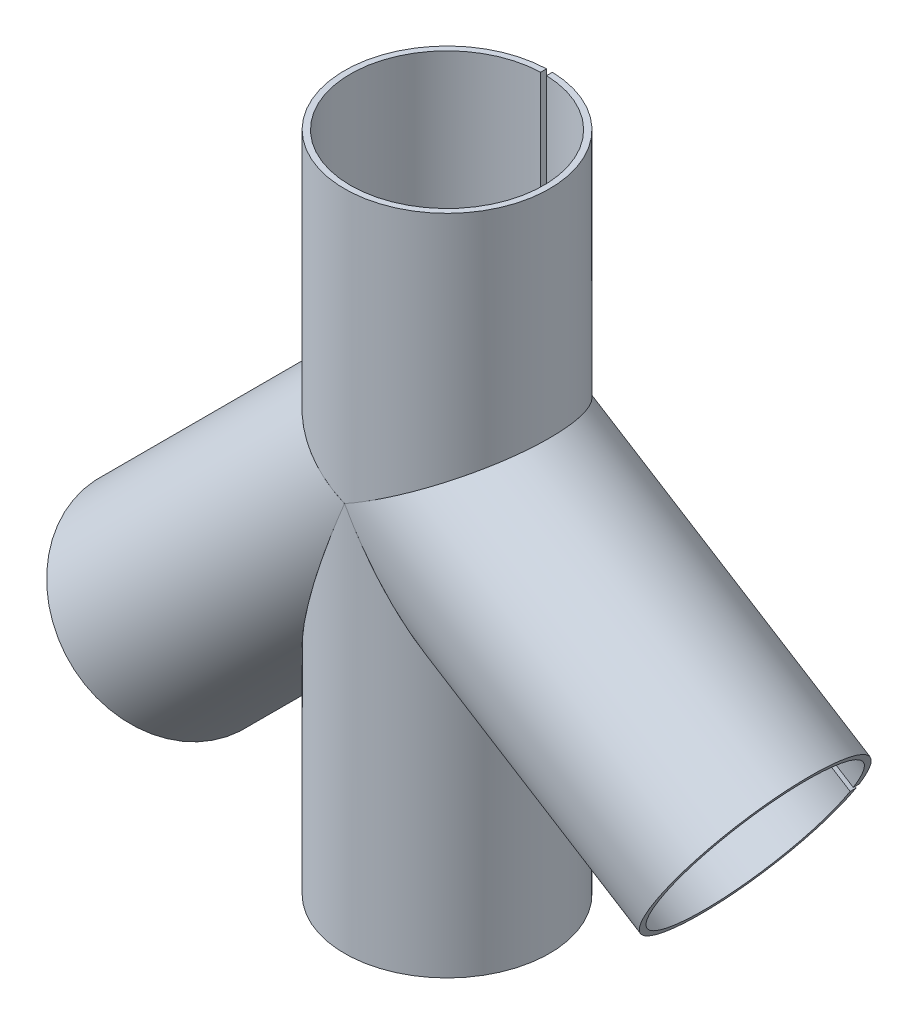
from build123d import *

# Parameters (mm, degrees)
SKETCH_2_R               = 17.363078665
SKETCH_2_R_2             = 16.363078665
EXTRUDE_1_DEPTH          = 46.170396
SKETCH_3_R               = 17.363078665
SKETCH_3_R_2             = 16.363078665
EXTRUDE_2_DEPTH          = 61.591845
SKETCH_4_R               = 17.363078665
SKETCH_4_R_2             = 16.363078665
EXTRUDE_3_DEPTH          = 65.849104
SKETCH_5_R               = 17.363078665
SKETCH_5_R_2             = 16.363078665
EXTRUDE_4_DEPTH          = 66
CUT_EXTRUDE_1_DEPTH      = 92.810284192
CUT_EXTRUDE_1_DEPTH_BACK = 92.810284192
SKETCH_6_OUTSIDE_W       = 155.868
SKETCH_6_OUTSIDE_H       = 147.784
CUT_EXTRUDE_2_DEPTH      = 92.810284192
CUT_EXTRUDE_2_DEPTH_BACK = 92.810284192
SKETCH_7_OUTSIDE_W       = 155.868
SKETCH_7_OUTSIDE_H       = 147.784
CUT_EXTRUDE_5_DEPTH      = 92.810284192
CUT_EXTRUDE_5_DEPTH_BACK = 92.810284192
SKETCH_10_OUTSIDE_W      = 155.868
SKETCH_10_OUTSIDE_H      = 147.784
CUT_EXTRUDE_6_DEPTH      = 92.810284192
CUT_EXTRUDE_6_DEPTH_BACK = 92.810284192
SKETCH_11_OUTSIDE_W      = 155.868
SKETCH_11_OUTSIDE_H      = 147.784
CUT_EXTRUDE_6_2_DEPTH    = 92.810284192
CUT_EXTRUDE_7_DEPTH      = 92.810284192


with BuildPart() as part:
    # Sketch 2 → Extrude 1 (new body)
    with BuildSketch(Plane(origin=(0, 0, 0), x_dir=(1, 0, 0), z_dir=(0, 1, 0))):
        Circle(SKETCH_2_R)
        Circle(SKETCH_2_R_2, mode=Mode.SUBTRACT)
    extrude(amount=EXTRUDE_1_DEPTH)

    # Sketch 6 outside → Cut-Extrude 1 (cut, two sides: drawn at the far end of the back side and taken through both)
    with BuildSketch(Plane.XY.offset(-CUT_EXTRUDE_1_DEPTH_BACK)):
        with Locations((1.287, -9.915)):
            Rectangle(SKETCH_6_OUTSIDE_W, SKETCH_6_OUTSIDE_H)
        Polygon((-17.363078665, 7.192022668), (0, 0), (17.363078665, 9.611805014), (17.363078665, 46.170395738), (-17.363078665, 46.170395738), align=None, mode=Mode.SUBTRACT)
    extrude(amount=CUT_EXTRUDE_1_DEPTH + CUT_EXTRUDE_1_DEPTH_BACK, mode=Mode.SUBTRACT)


with BuildPart() as body_2:
    # Sketch 3 → Extrude 2 (new body)
    with BuildSketch(Plane(origin=(52.196259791, -32.69718417, 0), x_dir=(0, 0, -1), z_dir=(0.8474540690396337, -0.5308687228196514, 0))):
        Circle(SKETCH_3_R)
        Circle(SKETCH_3_R_2, mode=Mode.SUBTRACT)
    extrude(amount=-EXTRUDE_2_DEPTH)

    # Sketch 11 outside → Cut-Extrude 6 (cut, two sides: drawn at the far end of the back side and taken through both)
    with BuildSketch(Plane.XY.offset(-CUT_EXTRUDE_6_DEPTH_BACK)):
        with Locations((1.287, -9.915)):
            Rectangle(SKETCH_11_OUTSIDE_W, SKETCH_11_OUTSIDE_H)
        Polygon((0, 0), (17.363078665, -31.365232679), (42.978744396, -47.411595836), (61.413775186, -17.982772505), (17.363078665, 9.611805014), align=None, mode=Mode.SUBTRACT)
    extrude(amount=CUT_EXTRUDE_6_DEPTH + CUT_EXTRUDE_6_DEPTH_BACK, mode=Mode.SUBTRACT)


with BuildPart() as body_3:
    # Sketch 4 → Extrude 3 (new body)
    with BuildSketch(Plane(origin=(-46.562348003, -46.562348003, 0), x_dir=(0.7071067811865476, -0.7071067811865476, 0), z_dir=(-0.7071067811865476, -0.7071067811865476, 0))):
        Circle(SKETCH_4_R)
        Circle(SKETCH_4_R_2, mode=Mode.SUBTRACT)
    extrude(amount=-EXTRUDE_3_DEPTH)

    # Sketch 7 outside → Cut-Extrude 2 (cut, two sides: drawn at the far end of the back side and taken through both)
    with BuildSketch(Plane.XY.offset(-CUT_EXTRUDE_2_DEPTH_BACK)):
        with Locations((1.287, -9.915)):
            Rectangle(SKETCH_7_OUTSIDE_W, SKETCH_7_OUTSIDE_H)
        Polygon((-17.363078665, 7.192022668), (0, 0), (-17.363078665, -41.918179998), (-34.284797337, -58.839898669), (-58.839898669, -34.284797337), align=None, mode=Mode.SUBTRACT)
    extrude(amount=CUT_EXTRUDE_2_DEPTH + CUT_EXTRUDE_2_DEPTH_BACK, mode=Mode.SUBTRACT)


with BuildPart() as body_4:
    # Sketch 5 → Extrude 4 (new body)
    with BuildSketch(Plane(origin=(0, 0, 0), x_dir=(1, 0, 0), z_dir=(0, 1, 0))):
        Circle(SKETCH_5_R)
        Circle(SKETCH_5_R_2, mode=Mode.SUBTRACT)
    extrude(amount=-EXTRUDE_4_DEPTH)

    # Sketch 10 outside → Cut-Extrude 5 (cut, two sides: drawn at the far end of the back side and taken through both)
    with BuildSketch(Plane.XY.offset(-CUT_EXTRUDE_5_DEPTH_BACK)):
        with Locations((1.287, -9.915)):
            Rectangle(SKETCH_10_OUTSIDE_W, SKETCH_10_OUTSIDE_H)
        Polygon((-17.363078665, -41.918179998), (-17.363078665, -66), (17.363078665, -66), (17.363078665, -31.365232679), (0, 0), align=None, mode=Mode.SUBTRACT)
    extrude(amount=CUT_EXTRUDE_5_DEPTH + CUT_EXTRUDE_5_DEPTH_BACK, mode=Mode.SUBTRACT)


with BuildPart() as cut_extrude_6_2_tool:
    # Sketch 1 → Cut-Extrude 6 2 (new, through all)
    with BuildSketch(Plane.XY):
        Polygon((52.461694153, -32.273457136), (0.5, 0.276788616), (0.5, 46.170395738), (-0.5, 46.170395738), (-0.5, -0.276788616), (51.93082543, -33.120911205), align=None)
    extrude(amount=-CUT_EXTRUDE_6_2_DEPTH)


with BuildPart() as part_1:
    add(part.part)

    # Cut-Extrude 6 2: cut by cut_extrude_6_2_tool
    add(cut_extrude_6_2_tool.part, mode=Mode.SUBTRACT)


with BuildPart() as body_2_1:
    add(body_2.part)

    # Cut-Extrude 6 2: cut by cut_extrude_6_2_tool
    add(cut_extrude_6_2_tool.part, mode=Mode.SUBTRACT)


with BuildPart() as cut_extrude_7_tool:
    # Sketch 12 → Cut-Extrude 7 (new, through all)
    with BuildSketch(Plane.XY):
        Polygon((0.5, -66), (0.5, 1.207106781), (-46.915901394, -46.208794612), (-46.208794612, -46.915901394), (-0.5, -1.207106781), (-0.5, -66), align=None)
    extrude(amount=-CUT_EXTRUDE_7_DEPTH)


with BuildPart() as body_3_1:
    add(body_3.part)

    # Cut-Extrude 7: cut by cut_extrude_7_tool
    add(cut_extrude_7_tool.part, mode=Mode.SUBTRACT)


with BuildPart() as body_4_1:
    add(body_4.part)

    # Cut-Extrude 7: cut by cut_extrude_7_tool
    add(cut_extrude_7_tool.part, mode=Mode.SUBTRACT)


solid = Compound([part_1.part, body_2_1.part, body_3_1.part, body_4_1.part])
